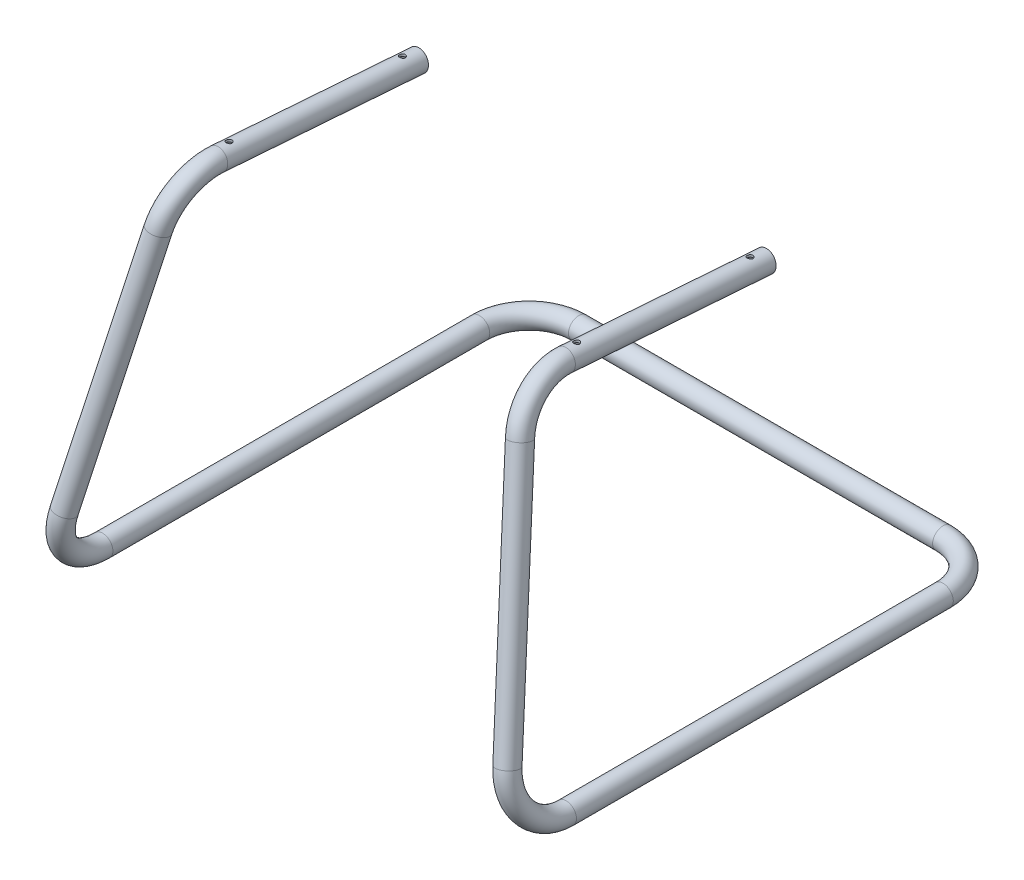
from build123d import *

# Parameters (mm, degrees)
ESQUISSE8_R                = 12.5
ESQUISSE8_R_2              = 10
R_P_TITION_LIN_AIRE1_COUNT = 2
R_P_TITION_LIN_AIRE1_PITCH = 210


with BuildPart() as part:
    # Balayage1: sweep along a curve in space
    with BuildLine() as balayage1_path:
        Line((0, -430, -250), (-220, -430, -250))
        ThreePointArc((-220, -430, -250), (-262.426406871, -430, -232.426406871), (-280, -430, -190))
        Line((-280, -430, -190), (-280, -430, 265.268061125))
        ThreePointArc((-280, -430, 265.268061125), (-276.209719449, -407.885980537, 312.05462668), (-267.673564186, -358.082621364, 323.85031523))
        Line((-218.551543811, -71.485019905, 259.492283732), (-267.673564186, -358.082621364, 323.85031523))
        ThreePointArc((-218.551543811, -71.485019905, 259.492283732), (-212.434047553, -36.873864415, 236.759984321), (-210, -25.38896785, 196.581808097))
        Line((-210, -25.38896785, 196.581808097), (-210, -43.197145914, -45.919434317))
    # Esquisse8 → Balayage1 (sweep)
    with BuildSketch(Plane(origin=(0, 0, 0), x_dir=(0, 0, -1), z_dir=(1, 0, 0))):
        with Locations((250, -430)):
            Circle(ESQUISSE8_R)
        with Locations((250, -430)):
            Circle(ESQUISSE8_R_2, mode=Mode.SUBTRACT)
    sweep(path=balayage1_path.line)

    # Esquisse9 → Enl_vement de mati_re-R_volution1 (revolve, cut)
    with BuildSketch(Plane(origin=(-210, 0, 0), x_dir=(0, 0, -1), z_dir=(1, 0, 0))):
        Polygon((26.925241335, -28.767293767), (25.02104821, -54.697470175), (17.02104821, -54.109986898), (21.861597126, -49.931737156), (23.434640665, -28.510960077), align=None)
    enl_vement_de_mati_re_r_volution1 = revolve(axis=Axis((-210, -28.767293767, -26.925241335), (0, -0.9973144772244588, 0.07323819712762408)), mode=Mode.SUBTRACT)

    # R_p_tition lin_aire1: Enl_vement de mati_re-R_volution1 ×2
    with Locations(*[Vector(0, 0.07323819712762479, 0.9973144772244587) * (i * R_P_TITION_LIN_AIRE1_PITCH) for i in range(1, R_P_TITION_LIN_AIRE1_COUNT)]):
        add(enl_vement_de_mati_re_r_volution1, mode=Mode.SUBTRACT)

    # Sym_trie1: part across plane


with BuildPart() as part_1:
    add(part.part)
    add(part.part.mirror(Plane(origin=(0, 0, 0), x_dir=(0, 0, 1), z_dir=(1, 0, 0))))


solid = part_1.part
